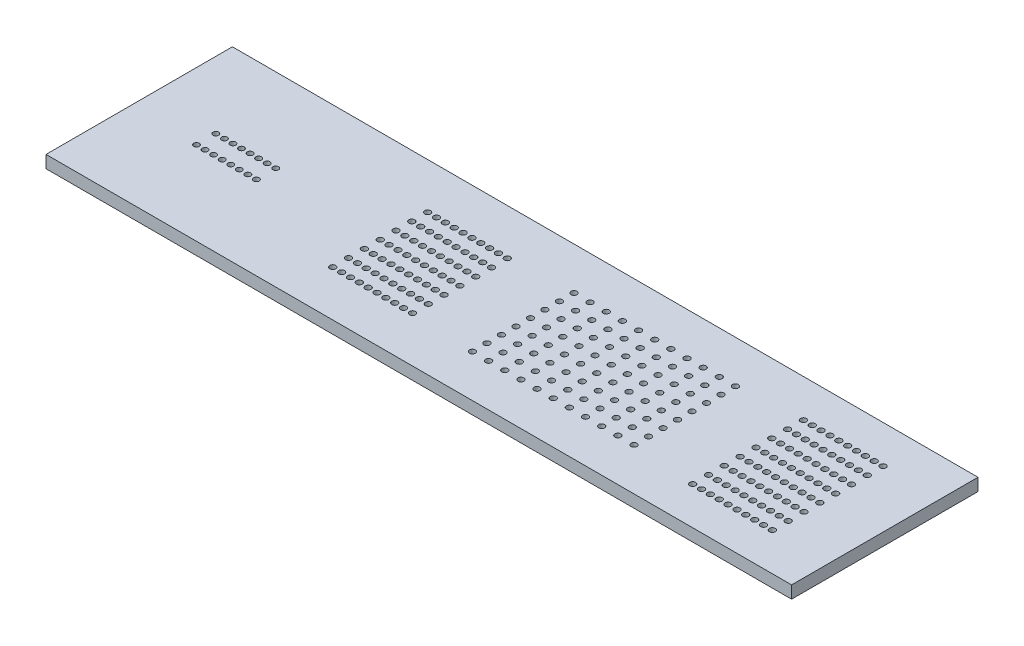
from build123d import *

# Parameters (mm, degrees)
ESQUISSE2_W                     = 120
ESQUISSE2_H                     = 30
BOSS_EXTRU_1_DEPTH              = 2
ENL_V_MAT_EXTRU_3_REACH         = 63.879
ESQUISSE8_R                     = 0.45
R_P_TITION_LIN_AIRE4_COUNT      = 8
R_P_TITION_LIN_AIRE4_PITCH      = 1.377
R_P_TITION_LIN_AIRE4_COUNT_DIR2 = 2
R_P_TITION_LIN_AIRE4_PITCH_DIR2 = 3.111
ENL_V_MAT_EXTRU_4_REACH         = 63.879
ESQUISSE10_R                    = 0.475
R_P_TITION_LIN_AIRE5_COUNT      = 10
R_P_TITION_LIN_AIRE5_PITCH      = 1.425
R_P_TITION_LIN_AIRE5_COUNT_DIR2 = 7
R_P_TITION_LIN_AIRE5_PITCH_DIR2 = 2.545
ENL_V_MAT_EXTRU_5_REACH         = 63.879
ESQUISSE12_R                    = 0.475
R_P_TITION_LIN_AIRE6_COUNT      = 11
R_P_TITION_LIN_AIRE6_PITCH      = 2.6
R_P_TITION_LIN_AIRE6_COUNT_DIR2 = 8
R_P_TITION_LIN_AIRE6_PITCH_DIR2 = 2.333
ENL_V_MAT_EXTRU_6_REACH         = 63.879
ESQUISSE14_R                    = 0.475
R_P_TITION_LIN_AIRE7_COUNT      = 10
R_P_TITION_LIN_AIRE7_PITCH      = 1.425
R_P_TITION_LIN_AIRE7_COUNT_DIR2 = 8
R_P_TITION_LIN_AIRE7_PITCH_DIR2 = 2.545


with BuildPart() as part:
    # Esquisse2 → Boss.-Extru.1 (new body)
    with BuildSketch(Plane(origin=(0, 0, 0), x_dir=(1, 0, 0), z_dir=(0, 1, 0))):
        Rectangle(ESQUISSE2_W, ESQUISSE2_H)
    extrude(amount=BOSS_EXTRU_1_DEPTH)

    # Esquisse8 → Enl_v. mat.-Extru.3 (cut, up to next)
    with BuildSketch(Plane(origin=(0, 2, 0), x_dir=(1, 0, 0), z_dir=(0, 1, 0)), mode=Mode.PRIVATE) as enl_v_mat_extru_3_sk1:
        with Locations(Location((-49.2195, 1.5555, 0), (0, 0, 270))):
            Circle(ESQUISSE8_R)
    enl_v_mat_extru_3_tool1 = extrude(enl_v_mat_extru_3_sk1.sketch, amount=-ENL_V_MAT_EXTRU_3_REACH, mode=Mode.PRIVATE) & part.part
    enl_v_mat_extru_3 = enl_v_mat_extru_3_tool1.solids().sort_by_distance((-49.2195, 2, -1.5555))[0]
    add(enl_v_mat_extru_3, mode=Mode.SUBTRACT)

    # R_p_tition lin_aire4: Enl_v. mat.-Extru.3 8 × 2
    with Locations(*[(i * R_P_TITION_LIN_AIRE4_PITCH, 0, j * R_P_TITION_LIN_AIRE4_PITCH_DIR2) for i in range(R_P_TITION_LIN_AIRE4_COUNT) for j in range(R_P_TITION_LIN_AIRE4_COUNT_DIR2) if (i, j) != (0, 0)]):
        add(enl_v_mat_extru_3, mode=Mode.SUBTRACT)

    # Esquisse10 → Enl_v. mat.-Extru.4 (cut, up to next)
    with BuildSketch(Plane(origin=(0, 2, 0), x_dir=(1, 0, 0), z_dir=(0, 1, 0)), mode=Mode.PRIVATE) as enl_v_mat_extru_4_sk1:
        with Locations(Location((-21.2125, 7.635, 0), (0, 0, 270))):
            Circle(ESQUISSE10_R)
    enl_v_mat_extru_4_tool1 = extrude(enl_v_mat_extru_4_sk1.sketch, amount=-ENL_V_MAT_EXTRU_4_REACH, mode=Mode.PRIVATE) & part.part
    enl_v_mat_extru_4 = enl_v_mat_extru_4_tool1.solids().sort_by_distance((-21.2125, 2, -7.635))[0]
    add(enl_v_mat_extru_4, mode=Mode.SUBTRACT)

    # R_p_tition lin_aire5: Enl_v. mat.-Extru.4 10 × 7
    with Locations(*[(i * R_P_TITION_LIN_AIRE5_PITCH, 0, j * R_P_TITION_LIN_AIRE5_PITCH_DIR2) for i in range(R_P_TITION_LIN_AIRE5_COUNT) for j in range(R_P_TITION_LIN_AIRE5_COUNT_DIR2) if (i, j) != (0, 0)]):
        add(enl_v_mat_extru_4, mode=Mode.SUBTRACT)

    # Esquisse12 → Enl_v. mat.-Extru.5 (cut, up to next)
    with BuildSketch(Plane(origin=(0, 2, 0), x_dir=(1, 0, 0), z_dir=(0, 1, 0)), mode=Mode.PRIVATE) as enl_v_mat_extru_5_sk1:
        with Locations(Location((1.8, 8.1655, 0), (0, 0, 270))):
            Circle(ESQUISSE12_R)
    enl_v_mat_extru_5_tool1 = extrude(enl_v_mat_extru_5_sk1.sketch, amount=-ENL_V_MAT_EXTRU_5_REACH, mode=Mode.PRIVATE) & part.part
    enl_v_mat_extru_5 = enl_v_mat_extru_5_tool1.solids().sort_by_distance((1.8, 2, -8.1655))[0]
    add(enl_v_mat_extru_5, mode=Mode.SUBTRACT)

    # R_p_tition lin_aire6: Enl_v. mat.-Extru.5 11 × 8
    with Locations(*[(i * R_P_TITION_LIN_AIRE6_PITCH, 0, j * R_P_TITION_LIN_AIRE6_PITCH_DIR2) for i in range(R_P_TITION_LIN_AIRE6_COUNT) for j in range(R_P_TITION_LIN_AIRE6_COUNT_DIR2) if (i, j) != (0, 0)]):
        add(enl_v_mat_extru_5, mode=Mode.SUBTRACT)

    # Esquisse14 → Enl_v. mat.-Extru.6 (cut, up to next)
    with BuildSketch(Plane(origin=(0, 2, 0), x_dir=(1, 0, 0), z_dir=(0, 1, 0)), mode=Mode.PRIVATE) as enl_v_mat_extru_6_sk1:
        with Locations(Location((37.9875, 8.9075, 0), (0, 0, 270))):
            Circle(ESQUISSE14_R)
    enl_v_mat_extru_6_tool1 = extrude(enl_v_mat_extru_6_sk1.sketch, amount=-ENL_V_MAT_EXTRU_6_REACH, mode=Mode.PRIVATE) & part.part
    enl_v_mat_extru_6 = enl_v_mat_extru_6_tool1.solids().sort_by_distance((37.9875, 2, -8.9075))[0]
    add(enl_v_mat_extru_6, mode=Mode.SUBTRACT)

    # R_p_tition lin_aire7: Enl_v. mat.-Extru.6 10 × 8
    with Locations(*[(i * R_P_TITION_LIN_AIRE7_PITCH, 0, j * R_P_TITION_LIN_AIRE7_PITCH_DIR2) for i in range(R_P_TITION_LIN_AIRE7_COUNT) for j in range(R_P_TITION_LIN_AIRE7_COUNT_DIR2) if (i, j) != (0, 0)]):
        add(enl_v_mat_extru_6, mode=Mode.SUBTRACT)


solid = part.part
